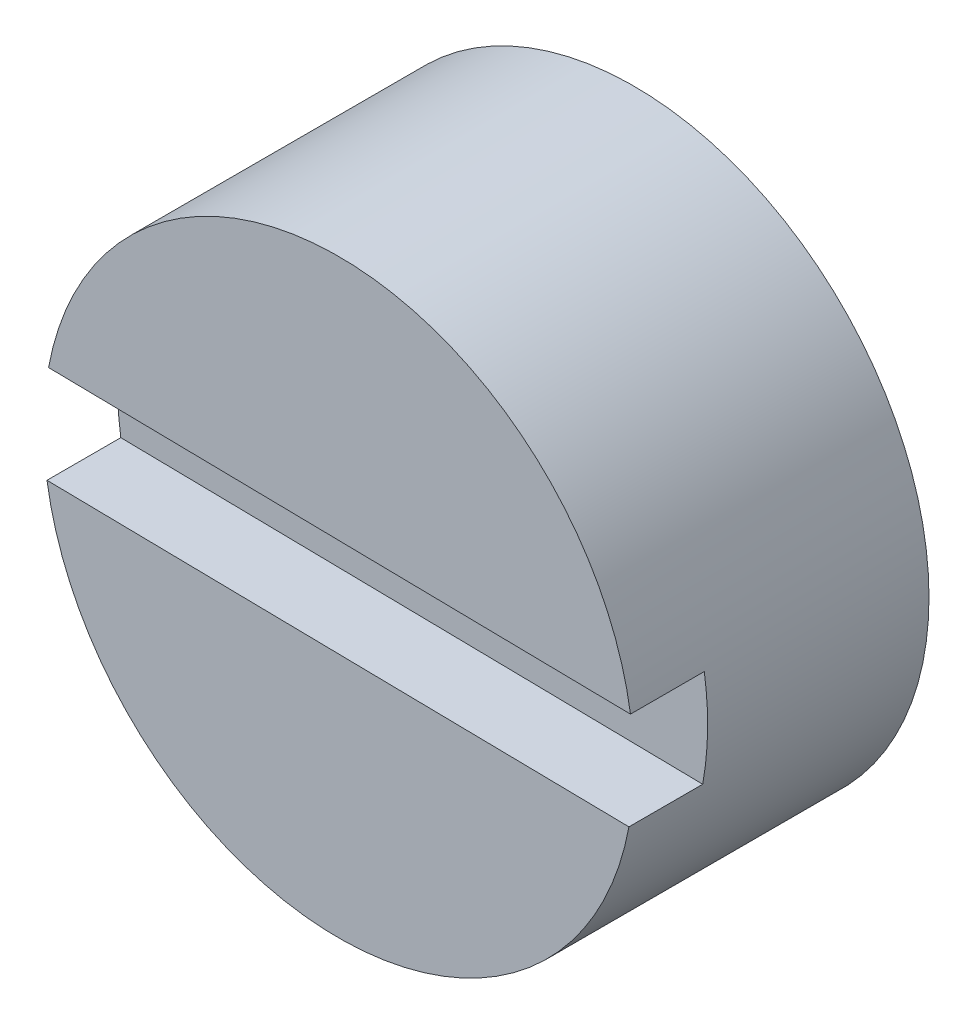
ISO-10303-21;
HEADER;
FILE_DESCRIPTION(('STEP AP214'),'2;1');
FILE_NAME('part.step','',(''),(''),'','','');
FILE_SCHEMA(('AUTOMOTIVE_DESIGN { 1 0 10303 214 1 1 1 1 }'));
ENDSEC;
DATA;
#1=APPLICATION_CONTEXT('core data for automotive mechanical design processes');
#2=APPLICATION_PROTOCOL_DEFINITION('international standard','automotive_design',2000,#1);
#3=PRODUCT_CONTEXT('',#1,'mechanical');
#4=PRODUCT('Part','Part','',(#3));
#5=PRODUCT_RELATED_PRODUCT_CATEGORY('part','',(#4));
#6=PRODUCT_DEFINITION_FORMATION('','',#4);
#7=PRODUCT_DEFINITION_CONTEXT('part definition',#1,'design');
#8=PRODUCT_DEFINITION('design','',#6,#7);
#9=PRODUCT_DEFINITION_SHAPE('','',#8);
#10=(LENGTH_UNIT() NAMED_UNIT(*) SI_UNIT(.MILLI.,.METRE.));
#11=(NAMED_UNIT(*) PLANE_ANGLE_UNIT() SI_UNIT($,.RADIAN.));
#12=(NAMED_UNIT(*) SI_UNIT($,.STERADIAN.) SOLID_ANGLE_UNIT());
#13=UNCERTAINTY_MEASURE_WITH_UNIT(LENGTH_MEASURE(1.E-05),#10,'distance_accuracy_value','');
#14=(GEOMETRIC_REPRESENTATION_CONTEXT(3) GLOBAL_UNCERTAINTY_ASSIGNED_CONTEXT((#13)) GLOBAL_UNIT_ASSIGNED_CONTEXT((#10,
#11,#12)) REPRESENTATION_CONTEXT('',''));
#15=CARTESIAN_POINT('',(0.,0.,0.));
#16=DIRECTION('',(0.,0.,1.));
#17=DIRECTION('',(1.,0.,0.));
#18=AXIS2_PLACEMENT_3D('',#15,#16,#17);
#19=CARTESIAN_POINT('',(0.,0.,3.));
#20=DIRECTION('',(0.,0.,-1.));
#21=DIRECTION('',(-1.,0.,0.));
#22=AXIS2_PLACEMENT_3D('',#19,#20,#21);
#23=PLANE('',#22);
#24=CARTESIAN_POINT('',(0.,0.,3.));
#25=DIRECTION('',(0.,0.,1.));
#26=DIRECTION('',(1.,0.,0.));
#27=AXIS2_PLACEMENT_3D('',#24,#25,#26);
#28=CIRCLE('',#27,3.);
#29=CARTESIAN_POINT('',(2.94978957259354,-0.54657248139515,3.));
#30=VERTEX_POINT('',#29);
#31=CARTESIAN_POINT('',(-2.96555495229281,-0.453303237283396,3.));
#32=VERTEX_POINT('',#31);
#33=EDGE_CURVE('E19',#30,#32,#28,.F.);
#34=ORIENTED_EDGE('',*,*,#33,.F.);
#35=DIRECTION('',(0.999875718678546,-0.015765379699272,0.));
#36=VECTOR('',#35,1.);
#37=CARTESIAN_POINT('',(-2.96555495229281,-0.453303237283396,3.));
#38=LINE('',#37,#36);
#39=EDGE_CURVE('E54',#30,#32,#38,.F.);
#40=ORIENTED_EDGE('',*,*,#39,.T.);
#41=EDGE_LOOP('',(#34,#40));
#42=FACE_BOUND('',#41,.T.);
#43=ADVANCED_FACE('F16',(#42),#23,.F.);
#44=CARTESIAN_POINT('',(-2.96555495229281,-0.453303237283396,3.));
#45=DIRECTION('',(-0.015765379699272,-0.999875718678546,0.));
#46=DIRECTION('',(0.999875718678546,-0.015765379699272,0.));
#47=AXIS2_PLACEMENT_3D('',#44,#45,#46);
#48=PLANE('',#47);
#49=DIRECTION('',(0.,0.,1.));
#50=VECTOR('',#49,1.);
#51=CARTESIAN_POINT('',(-2.96555495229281,-0.453303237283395,0.));
#52=LINE('',#51,#50);
#53=CARTESIAN_POINT('',(-2.96555495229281,-0.453303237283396,2.25));
#54=VERTEX_POINT('',#53);
#55=EDGE_CURVE('E62',#32,#54,#52,.F.);
#56=ORIENTED_EDGE('',*,*,#55,.F.);
#57=ORIENTED_EDGE('',*,*,#39,.F.);
#58=DIRECTION('',(0.,0.,1.));
#59=VECTOR('',#58,1.);
#60=CARTESIAN_POINT('',(2.94978957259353,-0.546572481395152,0.));
#61=LINE('',#60,#59);
#62=CARTESIAN_POINT('',(2.94978957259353,-0.546572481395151,2.25));
#63=VERTEX_POINT('',#62);
#64=EDGE_CURVE('E74',#63,#30,#61,.T.);
#65=ORIENTED_EDGE('',*,*,#64,.F.);
#66=DIRECTION('',(0.999875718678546,-0.0157653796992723,0.));
#67=VECTOR('',#66,1.);
#68=CARTESIAN_POINT('',(-2.96555495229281,-0.453303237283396,2.25));
#69=LINE('',#68,#67);
#70=EDGE_CURVE('E65',#54,#63,#69,.T.);
#71=ORIENTED_EDGE('',*,*,#70,.F.);
#72=EDGE_LOOP('',(#56,#57,#65,#71));
#73=FACE_BOUND('',#72,.T.);
#74=ADVANCED_FACE('F63',(#73),#48,.F.);
#75=CARTESIAN_POINT('',(0.,0.,3.));
#76=DIRECTION('',(0.,0.,-1.));
#77=DIRECTION('',(-1.,0.,0.));
#78=AXIS2_PLACEMENT_3D('',#75,#76,#77);
#79=PLANE('',#78);
#80=CARTESIAN_POINT('',(0.,0.,3.));
#81=DIRECTION('',(0.,0.,1.));
#82=DIRECTION('',(1.,0.,0.));
#83=AXIS2_PLACEMENT_3D('',#80,#81,#82);
#84=CIRCLE('',#83,3.);
#85=CARTESIAN_POINT('',(-2.94976654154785,0.546696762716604,3.));
#86=VERTEX_POINT('',#85);
#87=CARTESIAN_POINT('',(2.96553585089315,0.453428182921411,3.));
#88=VERTEX_POINT('',#87);
#89=EDGE_CURVE('E84',#86,#88,#84,.F.);
#90=ORIENTED_EDGE('',*,*,#89,.F.);
#91=DIRECTION('',(-0.999875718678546,0.015765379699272,0.));
#92=VECTOR('',#91,1.);
#93=CARTESIAN_POINT('',(2.96553585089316,0.453428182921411,3.));
#94=LINE('',#93,#92);
#95=EDGE_CURVE('E59',#86,#88,#94,.F.);
#96=ORIENTED_EDGE('',*,*,#95,.T.);
#97=EDGE_LOOP('',(#90,#96));
#98=FACE_BOUND('',#97,.T.);
#99=ADVANCED_FACE('F93',(#98),#79,.F.);
#100=CARTESIAN_POINT('',(2.96553585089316,0.453428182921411,3.));
#101=DIRECTION('',(0.015765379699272,0.999875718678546,0.));
#102=DIRECTION('',(-0.999875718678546,0.015765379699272,0.));
#103=AXIS2_PLACEMENT_3D('',#100,#101,#102);
#104=PLANE('',#103);
#105=DIRECTION('',(0.,0.,1.));
#106=VECTOR('',#105,1.);
#107=CARTESIAN_POINT('',(2.96553585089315,0.453428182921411,0.));
#108=LINE('',#107,#106);
#109=CARTESIAN_POINT('',(2.96553585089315,0.453428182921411,2.25));
#110=VERTEX_POINT('',#109);
#111=EDGE_CURVE('E79',#88,#110,#108,.F.);
#112=ORIENTED_EDGE('',*,*,#111,.F.);
#113=ORIENTED_EDGE('',*,*,#95,.F.);
#114=DIRECTION('',(0.,0.,1.));
#115=VECTOR('',#114,1.);
#116=CARTESIAN_POINT('',(-2.94976654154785,0.546696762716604,0.));
#117=LINE('',#116,#115);
#118=CARTESIAN_POINT('',(-2.94976654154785,0.546696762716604,2.25));
#119=VERTEX_POINT('',#118);
#120=EDGE_CURVE('E82',#119,#86,#117,.T.);
#121=ORIENTED_EDGE('',*,*,#120,.F.);
#122=DIRECTION('',(-0.999875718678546,0.0157653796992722,0.));
#123=VECTOR('',#122,1.);
#124=CARTESIAN_POINT('',(2.96553585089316,0.453428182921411,2.25));
#125=LINE('',#124,#123);
#126=EDGE_CURVE('E34',#110,#119,#125,.T.);
#127=ORIENTED_EDGE('',*,*,#126,.F.);
#128=EDGE_LOOP('',(#112,#113,#121,#127));
#129=FACE_BOUND('',#128,.T.);
#130=ADVANCED_FACE('F90',(#129),#104,.F.);
#131=CARTESIAN_POINT('',(9.59625389E-07,6.0861593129E-05,2.25));
#132=DIRECTION('',(0.,0.,1.));
#133=DIRECTION('',(1.,0.,0.));
#134=AXIS2_PLACEMENT_3D('',#131,#132,#133);
#135=PLANE('',#134);
#136=CARTESIAN_POINT('',(0.,0.,2.25));
#137=DIRECTION('',(0.,0.,1.));
#138=DIRECTION('',(1.,0.,0.));
#139=AXIS2_PLACEMENT_3D('',#136,#137,#138);
#140=CIRCLE('',#139,3.);
#141=EDGE_CURVE('E69',#54,#119,#140,.F.);
#142=ORIENTED_EDGE('',*,*,#141,.F.);
#143=ORIENTED_EDGE('',*,*,#70,.T.);
#144=CARTESIAN_POINT('',(0.,0.,2.25));
#145=DIRECTION('',(0.,0.,1.));
#146=DIRECTION('',(1.,0.,0.));
#147=AXIS2_PLACEMENT_3D('',#144,#145,#146);
#148=CIRCLE('',#147,3.);
#149=EDGE_CURVE('E25',#110,#63,#148,.F.);
#150=ORIENTED_EDGE('',*,*,#149,.F.);
#151=ORIENTED_EDGE('',*,*,#126,.T.);
#152=EDGE_LOOP('',(#142,#143,#150,#151));
#153=FACE_BOUND('',#152,.T.);
#154=ADVANCED_FACE('F89',(#153),#135,.T.);
#155=CARTESIAN_POINT('',(0.,0.,0.));
#156=DIRECTION('',(0.,0.,-1.));
#157=DIRECTION('',(-1.,0.,0.));
#158=AXIS2_PLACEMENT_3D('',#155,#156,#157);
#159=PLANE('',#158);
#160=CARTESIAN_POINT('',(0.,0.,0.));
#161=DIRECTION('',(0.,0.,1.));
#162=DIRECTION('',(1.,0.,0.));
#163=AXIS2_PLACEMENT_3D('',#160,#161,#162);
#164=CIRCLE('',#163,3.);
#165=CARTESIAN_POINT('',(3.,0.,0.));
#166=VERTEX_POINT('',#165);
#167=EDGE_CURVE('E11',#166,#166,#164,.T.);
#168=ORIENTED_EDGE('',*,*,#167,.F.);
#169=EDGE_LOOP('',(#168));
#170=FACE_BOUND('',#169,.T.);
#171=ADVANCED_FACE('F104',(#170),#159,.T.);
#172=CARTESIAN_POINT('',(0.,0.,0.));
#173=DIRECTION('',(0.,0.,1.));
#174=DIRECTION('',(1.,0.,0.));
#175=AXIS2_PLACEMENT_3D('',#172,#173,#174);
#176=CYLINDRICAL_SURFACE('',#175,3.);
#177=ORIENTED_EDGE('',*,*,#167,.T.);
#178=EDGE_LOOP('',(#177));
#179=FACE_BOUND('',#178,.T.);
#180=ORIENTED_EDGE('',*,*,#111,.T.);
#181=ORIENTED_EDGE('',*,*,#149,.T.);
#182=ORIENTED_EDGE('',*,*,#64,.T.);
#183=ORIENTED_EDGE('',*,*,#33,.T.);
#184=ORIENTED_EDGE('',*,*,#55,.T.);
#185=ORIENTED_EDGE('',*,*,#141,.T.);
#186=ORIENTED_EDGE('',*,*,#120,.T.);
#187=ORIENTED_EDGE('',*,*,#89,.T.);
#188=EDGE_LOOP('',(#180,#181,#182,#183,#184,#185,#186,#187));
#189=FACE_BOUND('',#188,.T.);
#190=ADVANCED_FACE('F72',(#179,#189),#176,.T.);
#191=CLOSED_SHELL('',(#43,#74,#99,#130,#154,#171,#190));
#192=MANIFOLD_SOLID_BREP('B1',#191);
#193=ADVANCED_BREP_SHAPE_REPRESENTATION('',(#18,#192),#14);
#194=SHAPE_DEFINITION_REPRESENTATION(#9,#193);
ENDSEC;
END-ISO-10303-21;
